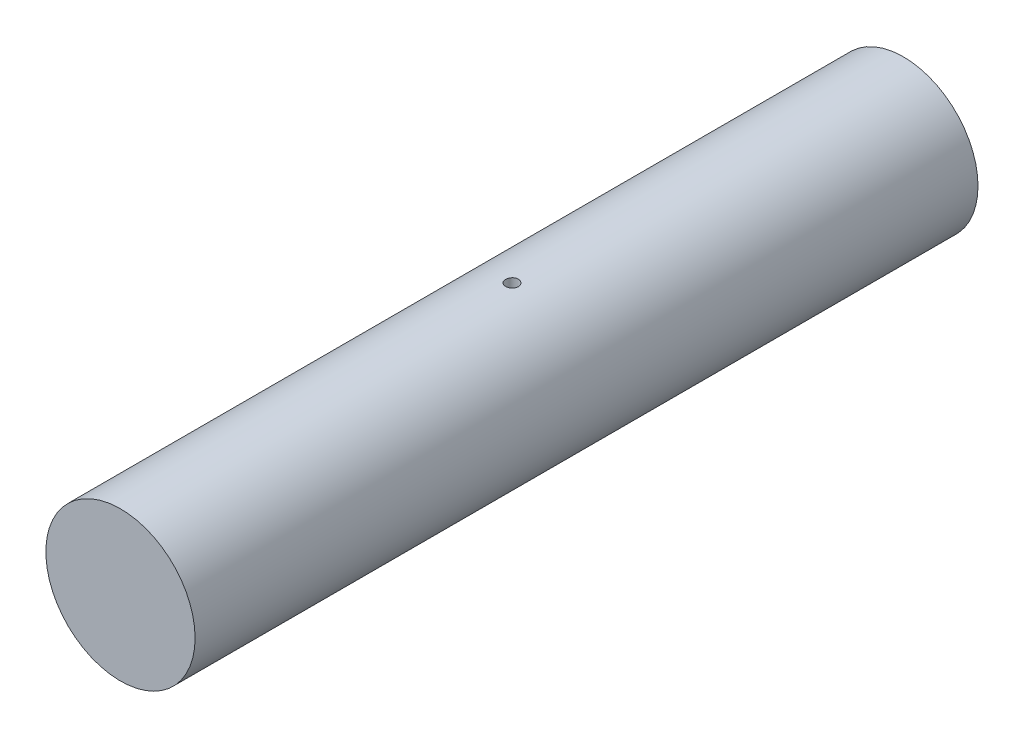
from build123d import *

# Parameters (mm, degrees)
SKETCH1_R               = 77.47
EXTRUDE1_DEPTH          = 406.4
CUT_EXTRUDE1_DEPTH      = 421.908733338
CUT_EXTRUDE1_DEPTH_BACK = 421.908733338
SKETCH2_R               = 6.604


with BuildPart() as part:
    # Sketch1 → Extrude1 (new, symmetric)
    with BuildSketch(Plane.XY):
        Circle(SKETCH1_R)
    extrude(amount=EXTRUDE1_DEPTH, both=True)

    # Sketch2 → Cut-Extrude1 (cut, two sides: drawn at the far end of the back side and taken through both)
    with BuildSketch(Plane(origin=(0, 0, 0), x_dir=(1, 0, 0), z_dir=(0, 1, 0)).offset(-CUT_EXTRUDE1_DEPTH_BACK)):
        with Locations(Location((0, 0, 0), (0, 0, 270))):
            Circle(SKETCH2_R)
    extrude(amount=CUT_EXTRUDE1_DEPTH + CUT_EXTRUDE1_DEPTH_BACK, mode=Mode.SUBTRACT)


solid = part.part
